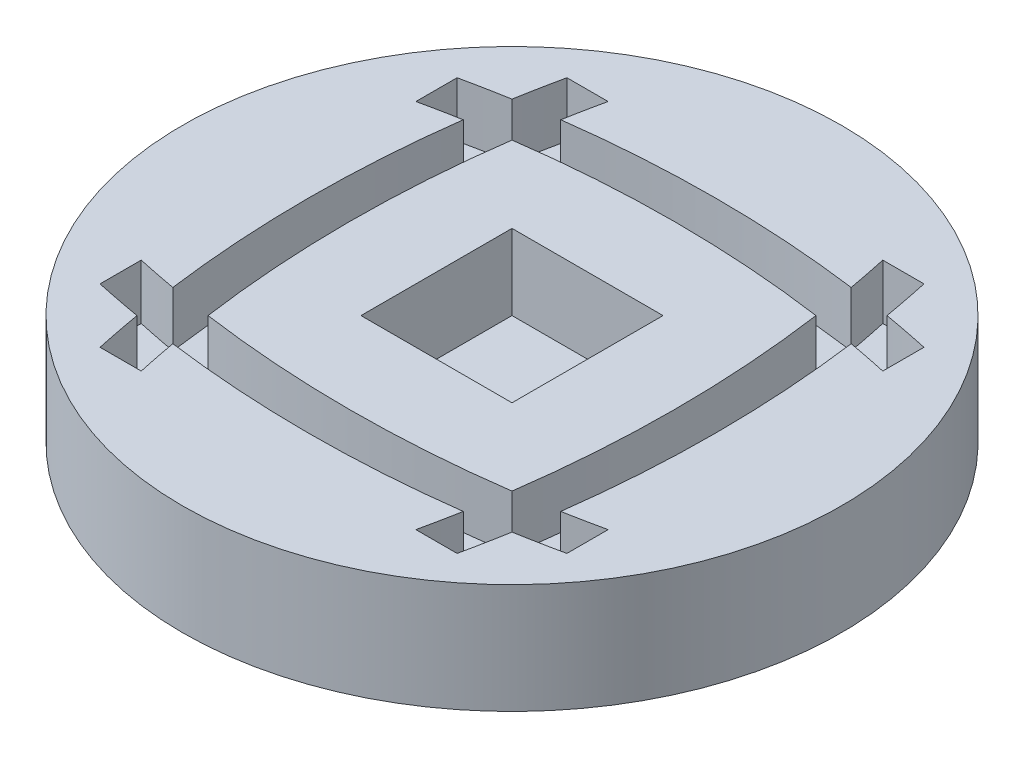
from build123d import *

# Parameters (mm, degrees)
SKETCH1_R           = 24
BOSS_EXTRUDE1_DEPTH = 8
SKETCH3_W           = 11
SKETCH3_H           = 11
CUT_EXTRUDE2_DEPTH  = 5.5
CUT_EXTRUDE6_DEPTH  = 4


with BuildPart() as part:
    # Sketch1 → Boss-Extrude1 (new body)
    with BuildSketch(Plane(origin=(0, 0, 0), x_dir=(1, 0, 0), z_dir=(0, 1, 0))):
        with Locations(Location((0, 0, 0), (0, 0, 270))):
            Circle(SKETCH1_R)
    extrude(amount=BOSS_EXTRUDE1_DEPTH)

    # Sketch3 → Cut-Extrude2 (cut)
    with BuildSketch(Plane(origin=(0, 8, 0), x_dir=(1, 0, 0), z_dir=(0, 1, 0))):
        Rectangle(SKETCH3_W, SKETCH3_H)
    extrude(amount=-CUT_EXTRUDE2_DEPTH, mode=Mode.SUBTRACT)

    # Sketch10 → Cut-Extrude6 (cut)
    with BuildSketch(Plane(origin=(0, 8, 0), x_dir=(1, 0, 0), z_dir=(0, 1, 0))):
        with BuildLine():
            Line((-17, 13), (-17, 10))
            ThreePointArc((-17, 10), (-15.565150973, 10.301241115), (-14.124974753, 10.575887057))
            ThreePointArc((-14.124974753, 10.575887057), (-14.827114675, 0), (-14.124974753, -10.575887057))
            ThreePointArc((-14.124974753, -10.575887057), (-15.565150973, -10.301241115), (-17, -10))
            Line((-17, -10), (-17, -13))
            ThreePointArc((-17, -13), (-15.330185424, -13.344535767), (-13.653407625, -13.653407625))
            ThreePointArc((-13.653407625, -13.653407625), (-13.344535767, -15.330185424), (-13, -17))
            Line((-13, -17), (-10, -17))
            ThreePointArc((-10, -17), (-10.301241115, -15.565150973), (-10.575887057, -14.124974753))
            ThreePointArc((-10.575887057, -14.124974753), (0, -14.827114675), (10.575887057, -14.124974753))
            ThreePointArc((10.575887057, -14.124974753), (10.301241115, -15.565150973), (10, -17))
            Line((10, -17), (13, -17))
            ThreePointArc((13, -17), (13.344535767, -15.330185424), (13.653407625, -13.653407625))
            ThreePointArc((13.653407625, -13.653407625), (15.330185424, -13.344535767), (17, -13))
            Line((17, -13), (17, -10))
            ThreePointArc((17, -10), (15.565150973, -10.301241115), (14.124974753, -10.575887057))
            ThreePointArc((14.124974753, -10.575887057), (14.827114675, 0), (14.124974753, 10.575887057))
            ThreePointArc((14.124974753, 10.575887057), (15.565150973, 10.301241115), (17, 10))
            Line((17, 10), (17, 13))
            ThreePointArc((17, 13), (15.330185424, 13.344535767), (13.653407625, 13.653407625))
            ThreePointArc((13.653407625, 13.653407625), (13.344535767, 15.330185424), (13, 17))
            Line((13, 17), (10, 17))
            ThreePointArc((10, 17), (10.301241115, 15.565150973), (10.575887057, 14.124974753))
            ThreePointArc((10.575887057, 14.124974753), (0, 14.827114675), (-10.575887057, 14.124974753))
            ThreePointArc((-10.575887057, 14.124974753), (-10.301241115, 15.565150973), (-10, 17))
            Line((-10, 17), (-13, 17))
            ThreePointArc((-13, 17), (-13.344535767, 15.330185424), (-13.653407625, 13.653407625))
            ThreePointArc((-13.653407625, 13.653407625), (-15.330185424, 13.344535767), (-17, 13))
        make_face()
        with BuildLine():
            ThreePointArc((-11.068117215, 11.068117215), (0, 11.844812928), (11.068117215, 11.068117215))
            ThreePointArc((11.068117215, 11.068117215), (11.844812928, 0), (11.068117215, -11.068117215))
            ThreePointArc((11.068117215, -11.068117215), (0, -11.844812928), (-11.068117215, -11.068117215))
            ThreePointArc((-11.068117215, -11.068117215), (-11.844812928, 0), (-11.068117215, 11.068117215))
        make_face(mode=Mode.SUBTRACT)
    extrude(amount=-CUT_EXTRUDE6_DEPTH, mode=Mode.SUBTRACT)


solid = part.part
